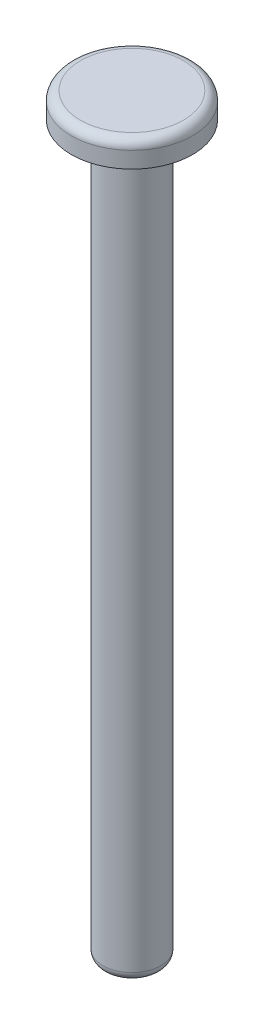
from build123d import *

# Parameters (mm, degrees)
ESQUISSE1_R      = 1.6
EXTRUSION1_DEPTH = 40.2
ESQUISSE2_R      = 3.35
EXTRUSION2_DEPTH = 1.4
CONG_1_R         = 0.5


with BuildPart() as part:
    # Esquisse1 → Extrusion1 (new body)
    with BuildSketch(Plane(origin=(0, 0, 0), x_dir=(1, 0, 0), z_dir=(0, 1, 0))):
        with Locations(Location((0, 0, 0), (0, 0, 270))):
            Circle(ESQUISSE1_R)
    extrude(amount=EXTRUSION1_DEPTH)

    # Esquisse2 → Extrusion2 (add)
    with BuildSketch(Plane(origin=(0, 40.2, 0), x_dir=(-1, 0, 0), z_dir=(0, 1, 0))):
        with Locations(Location((0, 0, 0), (0, 0, 90))):
            Circle(ESQUISSE2_R)
    extrude(amount=EXTRUSION2_DEPTH)

    # Cong_1
    cong_1_edges = [part.edges().sort_by_distance(p)[0] for p in [
        (0, 0, -1.6),
        (0, 41.6, -3.35),
    ]]
    fillet(cong_1_edges, radius=CONG_1_R)


solid = part.part
